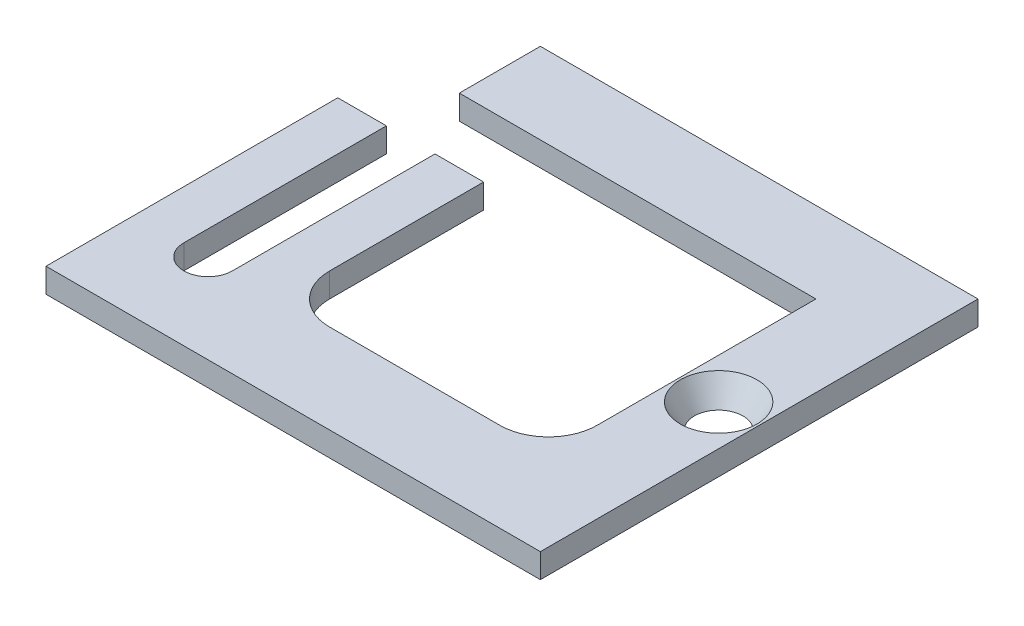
from build123d import *

# Parameters (mm, degrees)
SKETCH1_R      = 3
EXTRUDE1_DEPTH = 3
DRAFT6_ANGLE   = -30


with BuildPart() as part:
    # Sketch1 → Extrude1 (new body)
    with BuildSketch(Plane(origin=(0, 0, 0), x_dir=(1, 0, 0), z_dir=(0, 1, 0))):
        with BuildLine():
            Line((6, 11), (6, 36))
            Line((6, 36), (0, 36))
            Line((0, 36), (0, 0))
            Line((0, 0), (61, 0))
            Line((61, 0), (61, 54))
            Line((61, 54), (7, 54))
            Line((7, 54), (7, 44))
            Line((7, 44), (51, 44))
            Line((51, 44), (51, 17))
            ThreePointArc((51, 17), (49.242640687, 12.757359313), (45, 11))
            Line((45, 11), (24, 11))
            ThreePointArc((24, 11), (19.757359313, 12.757359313), (18, 17))
            Line((18, 17), (18, 36))
            Line((18, 36), (12, 36))
            Line((12, 36), (12, 11))
            ThreePointArc((12, 11), (9, 8), (6, 11))
        make_face()
        with Locations(Location((56, 27, 0), (0, 0, 270))):
            Circle(SKETCH1_R, mode=Mode.SUBTRACT)
    extrude(amount=EXTRUDE1_DEPTH)

    # Draft6
    draft6_faces = [part.faces().sort_by_distance(p)[0] for p in [
        (56, 1.5, -30),
    ]]
    draft(draft6_faces, Plane(origin=(9, 0, -11), x_dir=(0, 0, -1), z_dir=(0, -1, 0)), DRAFT6_ANGLE)


solid = part.part
